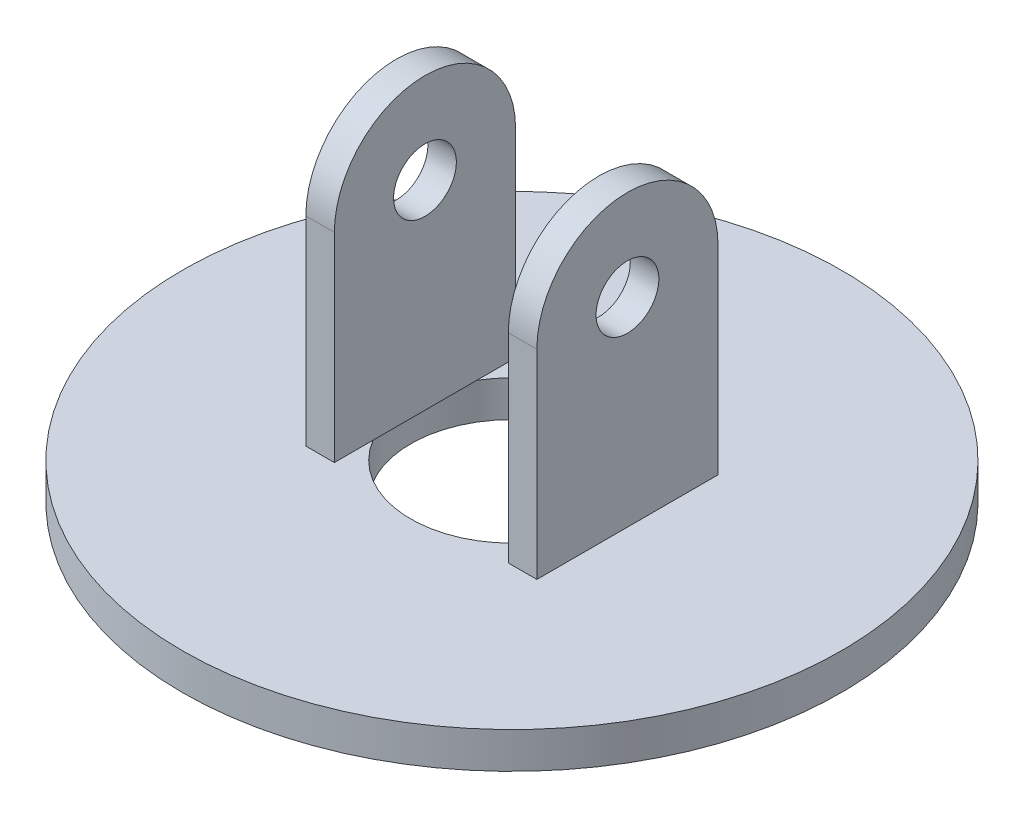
from build123d import *

# Parameters (mm, degrees)
SKETCH1_R           = 115.5
SKETCH1_R_2         = 35.5
BOSS_EXTRUDE1_DEPTH = 12.7
SKETCH2_W           = 10
SKETCH2_H           = 63.5
BOSS_EXTRUDE2_DEPTH = 101.6
FILLET1_RADIUS      = 31.75
FILLET1_LENGTH      = 10
FILLET2_RADIUS      = 31.75
FILLET2_LENGTH      = 10
SKETCH3_R           = 11
CUT_EXTRUDE1_DEPTH  = 101.6


with BuildPart() as part:
    # Sketch1 → Boss-Extrude1 (new body)
    with BuildSketch(Plane(origin=(0, 0, 0), x_dir=(1, 0, 0), z_dir=(0, 1, 0))):
        with Locations(Location((0, 0, 0), (0, 0, 270))):
            Circle(SKETCH1_R)
        with Locations(Location((0, 0, 0), (0, 0, 270))):
            Circle(SKETCH1_R_2, mode=Mode.SUBTRACT)
    extrude(amount=BOSS_EXTRUDE1_DEPTH)

    # Sketch2 → Boss-Extrude2 (add)
    with BuildSketch(Plane(origin=(0, 12.7, 0), x_dir=(1, 0, 0), z_dir=(0, 1, 0))):
        with Locations((35.48, 0)):
            Rectangle(SKETCH2_W, SKETCH2_H)
        with Locations((-35.48, 0)):
            Rectangle(SKETCH2_W, SKETCH2_H)
    extrude(amount=BOSS_EXTRUDE2_DEPTH)

    # Fillet1: full round fillet: the end face becomes a half cylinder, R = half its width
    fillet1_face = Plane((35.48, 114.3, 0), x_dir=(1, 0, 0), z_dir=(0, 1, 0))  # on the end face: x along it, z out of the body
    fillet1_slab = fillet1_face.offset(-FILLET1_RADIUS / 2) * Box(FILLET1_LENGTH, 2 * FILLET1_RADIUS, FILLET1_RADIUS, mode=Mode.PRIVATE)  # the body's end, R deep
    fillet1_round = Plane((35.48, 82.55, 0), x_dir=(0, 1, 0), z_dir=(1, 0, 0)) * Cylinder(FILLET1_RADIUS, FILLET1_LENGTH, mode=Mode.PRIVATE)  # its axis R under the face
    add(fillet1_slab - fillet1_round, mode=Mode.SUBTRACT)

    # Fillet2: full round fillet: the end face becomes a half cylinder, R = half its width
    fillet2_face = Plane((-35.48, 114.3, 0), x_dir=(1, 0, 0), z_dir=(0, 1, 0))  # on the end face: x along it, z out of the body
    fillet2_slab = fillet2_face.offset(-FILLET2_RADIUS / 2) * Box(FILLET2_LENGTH, 2 * FILLET2_RADIUS, FILLET2_RADIUS, mode=Mode.PRIVATE)  # the body's end, R deep
    fillet2_round = Plane((-35.48, 82.55, 0), x_dir=(0, 1, 0), z_dir=(1, 0, 0)) * Cylinder(FILLET2_RADIUS, FILLET2_LENGTH, mode=Mode.PRIVATE)  # its axis R under the face
    add(fillet2_slab - fillet2_round, mode=Mode.SUBTRACT)

    # Sketch3 → Cut-Extrude1 (cut)
    with BuildSketch(Plane.ZY.offset(40.48)):
        with Locations((0, 82.55)):
            Circle(SKETCH3_R)
    extrude(amount=-CUT_EXTRUDE1_DEPTH, mode=Mode.SUBTRACT)


solid = part.part
